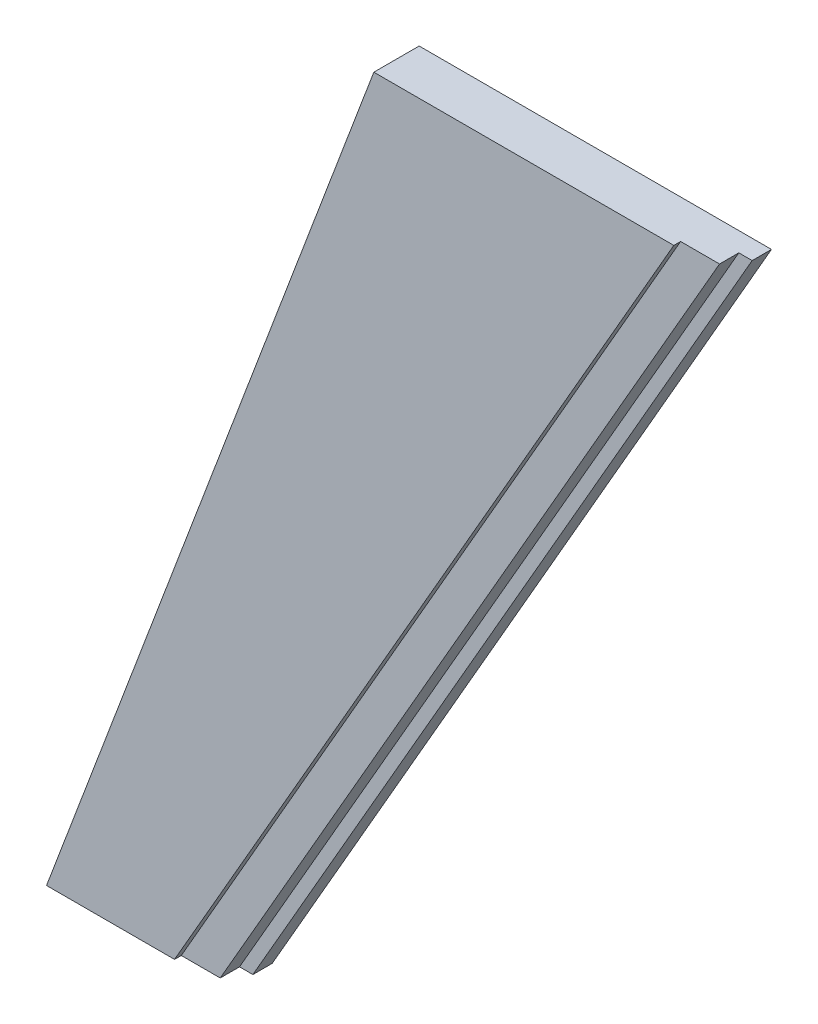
from build123d import *

# Parameters (mm, degrees)
EXTRUDE_1_DEPTH = 47
EXTRUDE_2_DEPTH = 40
EXTRUDE_3_DEPTH = 20


with BuildPart() as part:
    # Sketch 1 → Extrude 1 (new body)
    with BuildSketch(Plane.XY):
        Polygon((-620.780305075, 0), (-931.846836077, 0), (-1271.209662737, -900), (-1138.487052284, -900), align=None)
    extrude(amount=EXTRUDE_1_DEPTH)

    # Sketch 2 → Extrude 2 (add)
    with BuildSketch(Plane(origin=(0, 0, 0), x_dir=(-1, 0, 0), z_dir=(0, 0, -1))):
        Polygon((620.780305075, 0), (580.402844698, 0), (1098.109591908, -900), (1138.487052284, -900), align=None)
    extrude(amount=-EXTRUDE_2_DEPTH)

    # Sketch 3 → Extrude 3 (add)
    with BuildSketch(Plane(origin=(0, 0, 0), x_dir=(-1, 0, 0), z_dir=(0, 0, -1))):
        Polygon((580.402844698, 0), (566.559143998, 0), (1084.265891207, -900), (1098.109591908, -900), align=None)
    extrude(amount=-EXTRUDE_3_DEPTH)


solid = part.part
